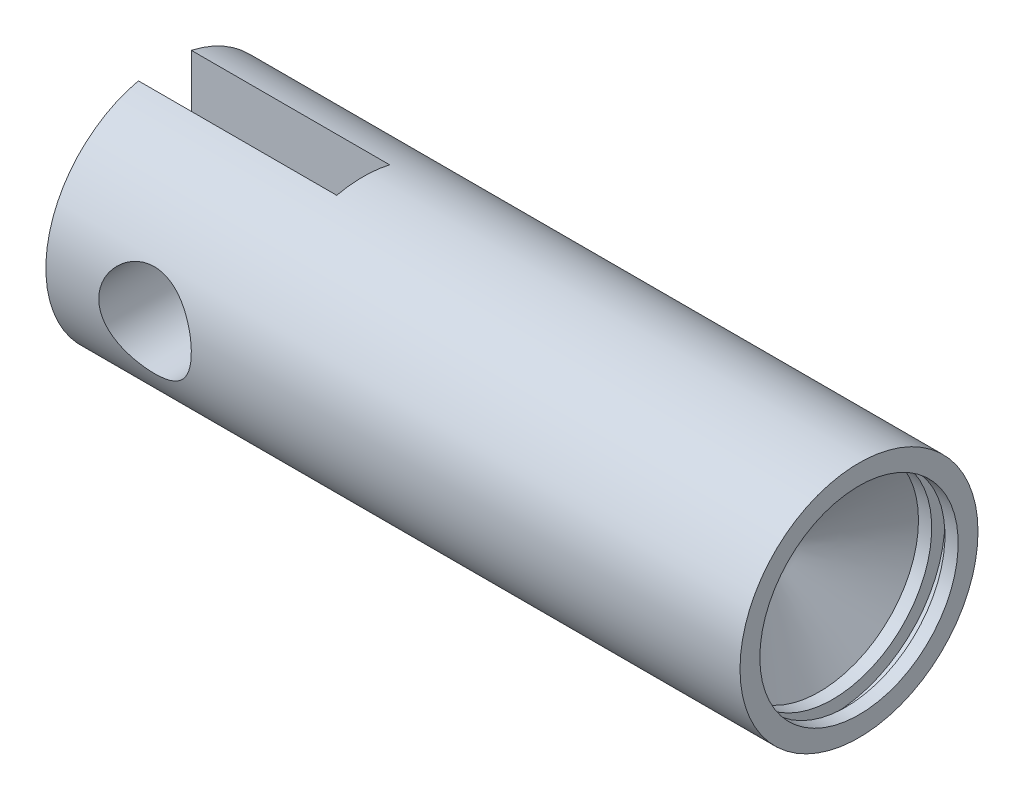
from build123d import *

# Parameters (mm, degrees)
ESQUISSE1_W                      = 105
ESQUISSE1_H                      = 18
ENL_V_MAT_EXTRU_1_DEPTH          = 30
EXTRUSION1_START                 = 30
EXTRUSION1_DEPTH                 = 30
ESQUISSE5_W                      = 7
ESQUISSE5_H                      = 14
DIAM_TRE_DU_PER_AGE_M14_0_14_2_D = 14


with BuildPart() as part:
    # Esquisse1 → R_volution1 (revolve)
    with BuildSketch(Plane.XY, mode=Mode.PRIVATE) as r_volution1_sk:
        with Locations((52.5, 9)):
            Rectangle(ESQUISSE1_W, ESQUISSE1_H)
    revolve(r_volution1_sk.sketch.rotate(Axis((0, 0, 0), (1, 0, 0)), 270), axis=Axis((0, 0, 0), (1, 0, 0)))

    # Esquisse2 → Enl_v. mat.-Extru.1 (cut)
    with BuildSketch(Plane.ZY):
        with BuildLine():
            Line((-4, 17.549928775), (-4, -17.549928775))
            ThreePointArc((-4, -17.549928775), (18, 0), (-4, 17.549928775))
        make_face()
    extrude(amount=-ENL_V_MAT_EXTRU_1_DEPTH, mode=Mode.SUBTRACT)

    # Esquisse3 → Extrusion1 (add)
    with BuildSketch(Plane.ZY.offset(-30).offset(EXTRUSION1_START)):
        with BuildLine():
            Line((4, -17.549928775), (4, 17.549928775))
            ThreePointArc((4, 17.549928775), (18, 0), (4, -17.549928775))
        make_face()
    extrude(amount=-EXTRUSION1_DEPTH)

    # Esquisse4 → Enl_vement de mati_re-R_volution1 (revolve, cut)
    with BuildSketch(Plane(origin=(0, 0, 0), x_dir=(-1, 0, 0), z_dir=(0, 0, -1)), mode=Mode.PRIVATE) as enl_vement_de_mati_re_r_volution1_sk:
        Polygon((-105, 15), (-105, 0), (-90.339745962, 0), (-99, 15), (-101, 15), (-101, 17), (-103, 17), (-103, 15), align=None)
    revolve(enl_vement_de_mati_re_r_volution1_sk.sketch.rotate(Axis((105.000025, 0, 0), (-1, 0, 0)), 270), axis=Axis((105.000025, 0, 0), (-1, 0, 0)), mode=Mode.SUBTRACT)

    # Esquisse5 → Diam_tre du per_age M14.0 _14_1 (revolve, cut)
    with BuildSketch(Plane(origin=(15, 0, 4), x_dir=(0, 1, 0), z_dir=(1, 0, 0))):
        with Locations((3.5, 7)):
            Rectangle(ESQUISSE5_W, ESQUISSE5_H)
    revolve(axis=Axis((15, 0, -2.35), (0, 0, 1)), mode=Mode.SUBTRACT)

    # Diam_tre du per_age M14.0 _14_2 (through all)
    with Locations(Plane.XY.offset(-4)):
        with Locations((15, 0)):
            Hole(DIAM_TRE_DU_PER_AGE_M14_0_14_2_D / 2)


solid = part.part
